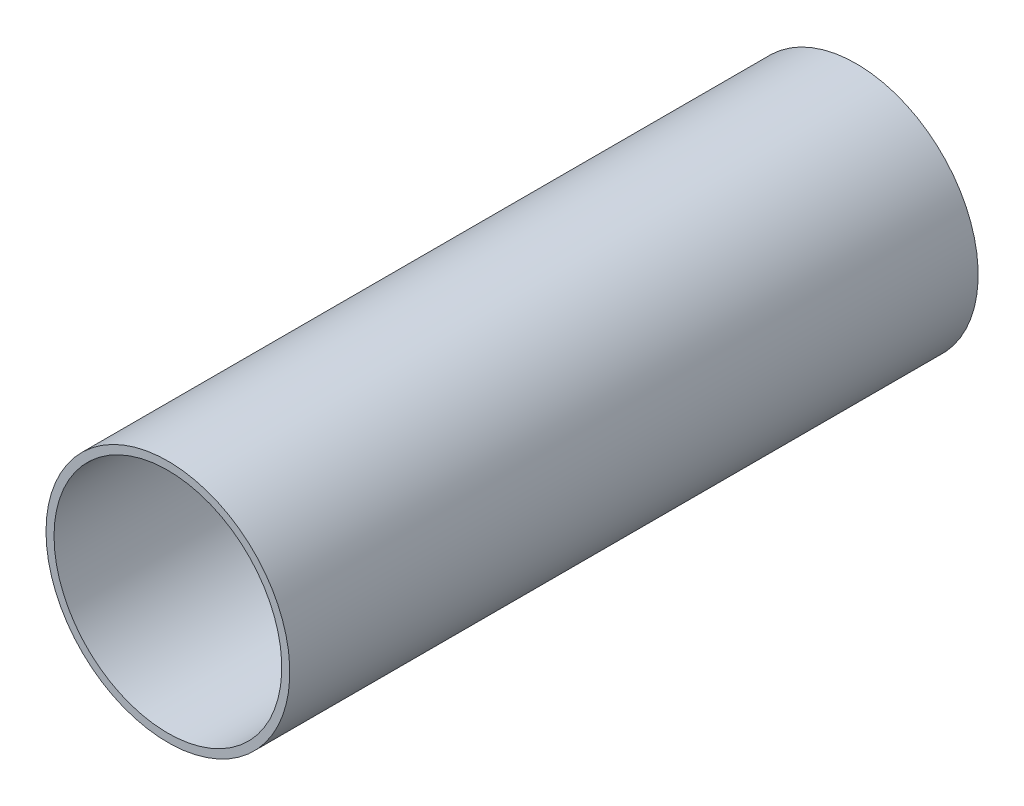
from build123d import *

# Parameters (mm, degrees)
SKETCH1_R           = 26.9875
SKETCH1_R_2         = 25.2095
BOSS_EXTRUDE1_DEPTH = 152.4


with BuildPart() as part:
    # Sketch1 → Boss-Extrude1 (new body)
    with BuildSketch(Plane.XY):
        with Locations(Location((0, 0, 0), (0, 0, 180))):
            Circle(SKETCH1_R)
        with Locations(Location((0, 0, 0), (0, 0, 180))):
            Circle(SKETCH1_R_2, mode=Mode.SUBTRACT)
    extrude(amount=BOSS_EXTRUDE1_DEPTH)


solid = part.part
